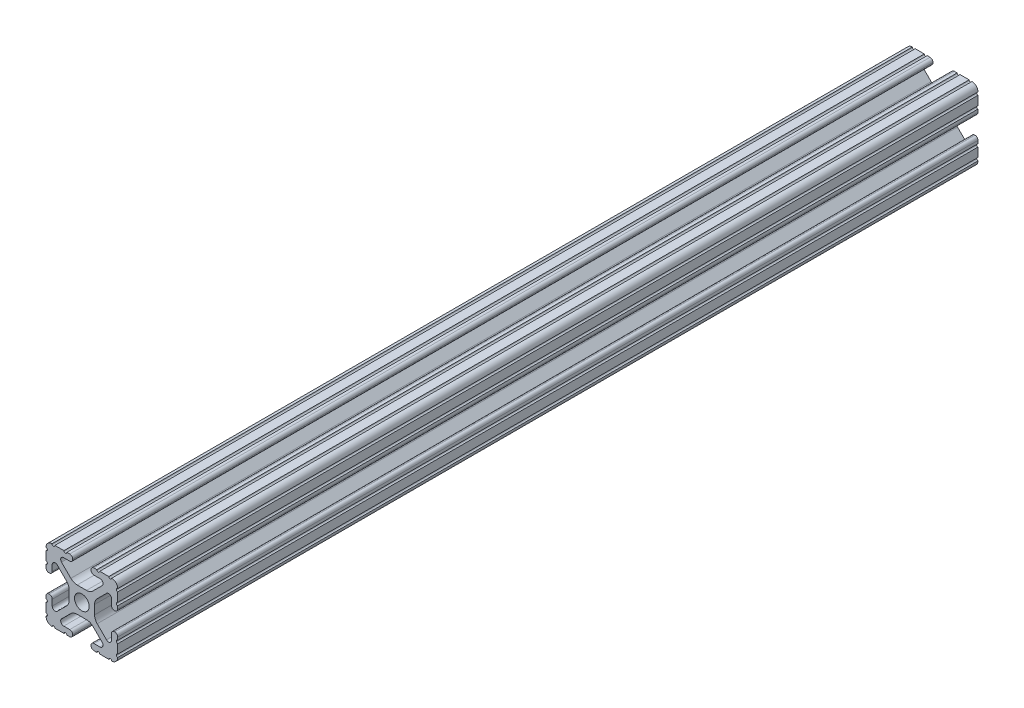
from build123d import *

# Parameters (mm, degrees)
SKETCH1_R           = 2.6035
BOSS_EXTRUDE1_DEPTH = 152.4


with BuildPart() as part:
    # Sketch1 → Boss-Extrude1 (new, symmetric)
    with BuildSketch(Plane.XY):
        with BuildLine():
            Line((-7.179650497, -8.645192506), (-3.952270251, -5.423690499))
            ThreePointArc((-3.952270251, -5.423690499), (-2.922936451, -4.736929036), (-1.709253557, -4.4958))
            Line((-1.709253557, -4.4958), (1.709253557, -4.4958))
            ThreePointArc((1.709253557, -4.4958), (2.922936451, -4.736929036), (3.952270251, -5.423690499))
            Line((3.952270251, -5.423690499), (7.179650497, -8.645192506))
            ThreePointArc((7.179650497, -8.645192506), (7.41473083, -9.822813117), (6.416408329, -10.4902))
            Line((6.416408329, -10.4902), (4.287512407, -10.4902))
            ThreePointArc((4.287512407, -10.4902), (3.54574862, -10.79744862), (3.2385, -11.539212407))
            Line((3.2385, -11.539212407), (3.2385, -11.650987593))
            ThreePointArc((3.2385, -11.650987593), (3.54574862, -12.39275138), (4.287512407, -12.7))
            Line((4.287512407, -12.7), (5.317126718, -12.7))
            ThreePointArc((5.317126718, -12.7), (5.825126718, -12.192), (6.333126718, -12.7))
            Line((6.333126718, -12.7), (9.550443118, -12.7))
            ThreePointArc((9.550443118, -12.7), (10.058366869, -12.192000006), (10.566443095, -12.699847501))
            ThreePointArc((10.566443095, -12.699847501), (12.082537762, -12.08250727), (12.699846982, -10.566399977))
            ThreePointArc((12.699846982, -10.566399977), (12.192000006, -10.058323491), (12.7, -9.5504))
            Line((12.7, -9.5504), (12.7, -6.3330836))
            ThreePointArc((12.7, -6.3330836), (12.192, -5.8250836), (12.7, -5.3170836))
            Line((12.7, -5.3170836), (12.7, -4.287469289))
            ThreePointArc((12.7, -4.287469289), (12.39275138, -3.545705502), (11.650987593, -3.238456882))
            Line((11.650987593, -3.238456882), (11.539212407, -3.238456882))
            ThreePointArc((11.539212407, -3.238456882), (10.79744862, -3.545705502), (10.4902, -4.287469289))
            Line((10.4902, -4.287469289), (10.4902, -6.402089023))
            ThreePointArc((10.4902, -6.402089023), (9.856505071, -7.351067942), (8.737131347, -7.129408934))
            Line((8.737131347, -7.129408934), (5.441005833, -3.840816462))
            ThreePointArc((5.441005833, -3.840816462), (4.750877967, -2.809883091), (4.5085, -1.593185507))
            Line((4.5085, -1.593185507), (4.5085, 1.593185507))
            ThreePointArc((4.5085, 1.593185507), (4.750877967, 2.809883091), (5.441005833, 3.840816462))
            Line((5.441005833, 3.840816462), (8.737131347, 7.129408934))
            ThreePointArc((8.737131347, 7.129408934), (9.856505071, 7.351067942), (10.4902, 6.402089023))
            Line((10.4902, 6.402089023), (10.4902, 4.287469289))
            ThreePointArc((10.4902, 4.287469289), (10.79744862, 3.545705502), (11.539212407, 3.238456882))
            Line((11.539212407, 3.238456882), (11.650987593, 3.238456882))
            ThreePointArc((11.650987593, 3.238456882), (12.39275138, 3.545705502), (12.7, 4.287469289))
            Line((12.7, 4.287469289), (12.7, 5.3170836))
            ThreePointArc((12.7, 5.3170836), (12.192, 5.8250836), (12.7, 6.3330836))
            Line((12.7, 6.3330836), (12.7, 9.5504))
            ThreePointArc((12.7, 9.5504), (12.192000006, 10.058323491), (12.699846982, 10.566399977))
            ThreePointArc((12.699846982, 10.566399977), (12.082537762, 12.08250727), (10.566443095, 12.699847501))
            ThreePointArc((10.566443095, 12.699847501), (10.058366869, 12.192000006), (9.550443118, 12.7))
            Line((9.550443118, 12.7), (6.333126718, 12.7))
            ThreePointArc((6.333126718, 12.7), (5.825126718, 12.192), (5.317126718, 12.7))
            Line((5.317126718, 12.7), (4.287512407, 12.7))
            ThreePointArc((4.287512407, 12.7), (3.54574862, 12.39275138), (3.2385, 11.650987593))
            Line((3.2385, 11.650987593), (3.2385, 11.539212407))
            ThreePointArc((3.2385, 11.539212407), (3.54574862, 10.79744862), (4.287512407, 10.4902))
            Line((4.287512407, 10.4902), (6.476788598, 10.4902))
            ThreePointArc((6.476788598, 10.4902), (7.432222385, 9.85140422), (7.207036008, 8.724370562))
            Line((7.207036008, 8.724370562), (3.898272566, 5.423169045))
            ThreePointArc((3.898272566, 5.423169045), (2.869120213, 4.736787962), (1.655778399, 4.4958))
            Line((1.655778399, 4.4958), (-1.655778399, 4.4958))
            ThreePointArc((-1.655778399, 4.4958), (-2.869120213, 4.736787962), (-3.898272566, 5.423169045))
            Line((-3.898272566, 5.423169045), (-7.207036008, 8.724370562))
            ThreePointArc((-7.207036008, 8.724370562), (-7.432222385, 9.85140422), (-6.476788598, 10.4902))
            Line((-6.476788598, 10.4902), (-4.287512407, 10.4902))
            ThreePointArc((-4.287512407, 10.4902), (-3.54574862, 10.79744862), (-3.2385, 11.539212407))
            Line((-3.2385, 11.539212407), (-3.2385, 11.650987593))
            ThreePointArc((-3.2385, 11.650987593), (-3.54574862, 12.39275138), (-4.287512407, 12.7))
            Line((-4.287512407, 12.7), (-5.317126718, 12.7))
            ThreePointArc((-5.317126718, 12.7), (-5.825126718, 12.192), (-6.333126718, 12.7))
            Line((-6.333126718, 12.7), (-9.550443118, 12.7))
            ThreePointArc((-9.550443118, 12.7), (-10.058366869, 12.192000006), (-10.566443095, 12.699847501))
            ThreePointArc((-10.566443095, 12.699847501), (-12.082537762, 12.08250727), (-12.699846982, 10.566399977))
            ThreePointArc((-12.699846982, 10.566399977), (-12.192000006, 10.058323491), (-12.7, 9.5504))
            Line((-12.7, 9.5504), (-12.7, 6.3330836))
            ThreePointArc((-12.7, 6.3330836), (-12.192, 5.8250836), (-12.7, 5.3170836))
            Line((-12.7, 5.3170836), (-12.7, 4.287469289))
            ThreePointArc((-12.7, 4.287469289), (-12.39275138, 3.545705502), (-11.650987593, 3.238456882))
            Line((-11.650987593, 3.238456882), (-11.539212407, 3.238456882))
            ThreePointArc((-11.539212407, 3.238456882), (-10.79744862, 3.545705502), (-10.4902, 4.287469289))
            Line((-10.4902, 4.287469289), (-10.4902, 6.402089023))
            ThreePointArc((-10.4902, 6.402089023), (-9.856505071, 7.351067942), (-8.737131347, 7.129408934))
            Line((-8.737131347, 7.129408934), (-5.441005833, 3.840816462))
            ThreePointArc((-5.441005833, 3.840816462), (-4.750877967, 2.809883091), (-4.5085, 1.593185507))
            Line((-4.5085, 1.593185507), (-4.5085, -1.593185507))
            ThreePointArc((-4.5085, -1.593185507), (-4.750877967, -2.809883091), (-5.441005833, -3.840816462))
            Line((-5.441005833, -3.840816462), (-8.737131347, -7.129408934))
            ThreePointArc((-8.737131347, -7.129408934), (-9.856505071, -7.351067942), (-10.4902, -6.402089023))
            Line((-10.4902, -6.402089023), (-10.4902, -4.287469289))
            ThreePointArc((-10.4902, -4.287469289), (-10.79744862, -3.545705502), (-11.539212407, -3.238456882))
            Line((-11.539212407, -3.238456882), (-11.650987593, -3.238456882))
            ThreePointArc((-11.650987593, -3.238456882), (-12.39275138, -3.545705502), (-12.7, -4.287469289))
            Line((-12.7, -4.287469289), (-12.7, -5.3170836))
            ThreePointArc((-12.7, -5.3170836), (-12.192, -5.8250836), (-12.7, -6.3330836))
            Line((-12.7, -6.3330836), (-12.7, -9.5504))
            ThreePointArc((-12.7, -9.5504), (-12.192000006, -10.058323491), (-12.699846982, -10.566399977))
            ThreePointArc((-12.699846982, -10.566399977), (-12.082537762, -12.08250727), (-10.566443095, -12.699847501))
            ThreePointArc((-10.566443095, -12.699847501), (-10.058366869, -12.192000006), (-9.550443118, -12.7))
            Line((-9.550443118, -12.7), (-6.333126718, -12.7))
            ThreePointArc((-6.333126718, -12.7), (-5.825126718, -12.192), (-5.317126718, -12.7))
            Line((-5.317126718, -12.7), (-4.287512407, -12.7))
            ThreePointArc((-4.287512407, -12.7), (-3.54574862, -12.39275138), (-3.2385, -11.650987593))
            Line((-3.2385, -11.650987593), (-3.2385, -11.539212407))
            ThreePointArc((-3.2385, -11.539212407), (-3.54574862, -10.79744862), (-4.287512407, -10.4902))
            Line((-4.287512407, -10.4902), (-6.416408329, -10.4902))
            ThreePointArc((-6.416408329, -10.4902), (-7.41473083, -9.822813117), (-7.179650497, -8.645192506))
        make_face()
        with Locations(Location((0, 0, 0), (0, 0, 180))):
            Circle(SKETCH1_R, mode=Mode.SUBTRACT)
    extrude(amount=BOSS_EXTRUDE1_DEPTH, both=True)


solid = part.part
